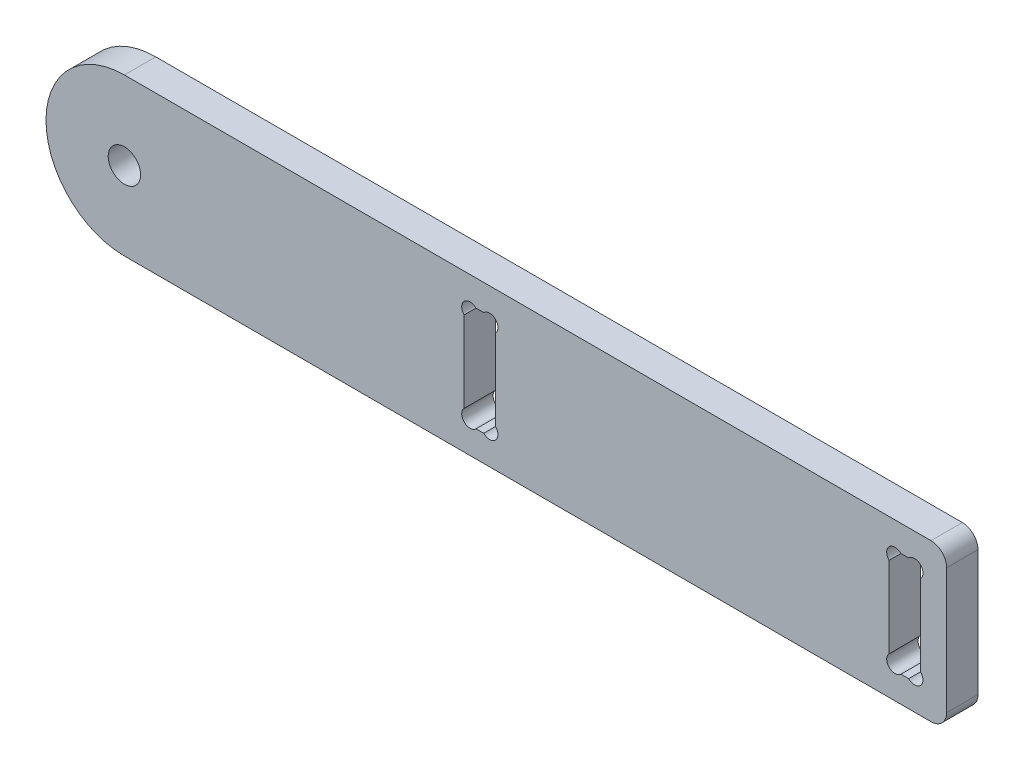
ISO-10303-21;
HEADER;
FILE_DESCRIPTION(('STEP AP214'),'2;1');
FILE_NAME('part.step','',(''),(''),'','','');
FILE_SCHEMA(('AUTOMOTIVE_DESIGN { 1 0 10303 214 1 1 1 1 }'));
ENDSEC;
DATA;
#1=APPLICATION_CONTEXT('core data for automotive mechanical design processes');
#2=APPLICATION_PROTOCOL_DEFINITION('international standard','automotive_design',2000,#1);
#3=PRODUCT_CONTEXT('',#1,'mechanical');
#4=PRODUCT('Part','Part','',(#3));
#5=PRODUCT_RELATED_PRODUCT_CATEGORY('part','',(#4));
#6=PRODUCT_DEFINITION_FORMATION('','',#4);
#7=PRODUCT_DEFINITION_CONTEXT('part definition',#1,'design');
#8=PRODUCT_DEFINITION('design','',#6,#7);
#9=PRODUCT_DEFINITION_SHAPE('','',#8);
#10=(LENGTH_UNIT() NAMED_UNIT(*) SI_UNIT(.MILLI.,.METRE.));
#11=(NAMED_UNIT(*) PLANE_ANGLE_UNIT() SI_UNIT($,.RADIAN.));
#12=(NAMED_UNIT(*) SI_UNIT($,.STERADIAN.) SOLID_ANGLE_UNIT());
#13=UNCERTAINTY_MEASURE_WITH_UNIT(LENGTH_MEASURE(1.E-05),#10,'distance_accuracy_value','');
#14=(GEOMETRIC_REPRESENTATION_CONTEXT(3) GLOBAL_UNCERTAINTY_ASSIGNED_CONTEXT((#13)) GLOBAL_UNIT_ASSIGNED_CONTEXT((#10,
#11,#12)) REPRESENTATION_CONTEXT('',''));
#15=CARTESIAN_POINT('',(0.,0.,0.));
#16=DIRECTION('',(0.,0.,1.));
#17=DIRECTION('',(1.,0.,0.));
#18=AXIS2_PLACEMENT_3D('',#15,#16,#17);
#19=CARTESIAN_POINT('',(94.31,27.,6.));
#20=DIRECTION('',(0.,0.,-1.));
#21=DIRECTION('',(-1.,0.,0.));
#22=AXIS2_PLACEMENT_3D('',#19,#20,#21);
#23=PLANE('',#22);
#24=CARTESIAN_POINT('',(9.86862915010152,23.8686291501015,6.));
#25=DIRECTION('',(0.,0.,1.));
#26=DIRECTION('',(1.,0.,0.));
#27=AXIS2_PLACEMENT_3D('',#24,#25,#26);
#28=CIRCLE('',#27,1.6);
#29=CARTESIAN_POINT('',(11.,22.737258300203,6.));
#30=VERTEX_POINT('',#29);
#31=CARTESIAN_POINT('',(8.73725830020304,25.,6.));
#32=VERTEX_POINT('',#31);
#33=EDGE_CURVE('E262',#30,#32,#28,.T.);
#34=ORIENTED_EDGE('',*,*,#33,.F.);
#35=DIRECTION('',(0.,1.,0.));
#36=VECTOR('',#35,1.);
#37=CARTESIAN_POINT('',(11.,22.737258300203,6.));
#38=LINE('',#37,#36);
#39=CARTESIAN_POINT('',(11.,7.26274169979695,6.));
#40=VERTEX_POINT('',#39);
#41=EDGE_CURVE('E277',#40,#30,#38,.T.);
#42=ORIENTED_EDGE('',*,*,#41,.F.);
#43=CARTESIAN_POINT('',(9.86862915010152,6.13137084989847,6.));
#44=DIRECTION('',(0.,0.,1.));
#45=DIRECTION('',(-1.,0.,0.));
#46=AXIS2_PLACEMENT_3D('',#43,#44,#45);
#47=CIRCLE('',#46,1.6);
#48=CARTESIAN_POINT('',(8.73725830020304,5.,6.));
#49=VERTEX_POINT('',#48);
#50=EDGE_CURVE('E274',#49,#40,#47,.T.);
#51=ORIENTED_EDGE('',*,*,#50,.F.);
#52=DIRECTION('',(1.,0.,0.));
#53=VECTOR('',#52,1.);
#54=CARTESIAN_POINT('',(7.26274169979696,5.,6.));
#55=LINE('',#54,#53);
#56=CARTESIAN_POINT('',(7.26274169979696,5.,6.));
#57=VERTEX_POINT('',#56);
#58=EDGE_CURVE('E272',#57,#49,#55,.T.);
#59=ORIENTED_EDGE('',*,*,#58,.F.);
#60=CARTESIAN_POINT('',(6.13137084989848,6.13137084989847,6.));
#61=DIRECTION('',(0.,0.,1.));
#62=DIRECTION('',(1.,0.,0.));
#63=AXIS2_PLACEMENT_3D('',#60,#61,#62);
#64=CIRCLE('',#63,1.6);
#65=CARTESIAN_POINT('',(5.,7.26274169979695,6.));
#66=VERTEX_POINT('',#65);
#67=EDGE_CURVE('E270',#66,#57,#64,.T.);
#68=ORIENTED_EDGE('',*,*,#67,.F.);
#69=DIRECTION('',(0.,-1.,0.));
#70=VECTOR('',#69,1.);
#71=CARTESIAN_POINT('',(5.,22.737258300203,6.));
#72=LINE('',#71,#70);
#73=CARTESIAN_POINT('',(5.,22.737258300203,6.));
#74=VERTEX_POINT('',#73);
#75=EDGE_CURVE('E268',#74,#66,#72,.T.);
#76=ORIENTED_EDGE('',*,*,#75,.F.);
#77=CARTESIAN_POINT('',(6.13137084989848,23.8686291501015,6.));
#78=DIRECTION('',(0.,0.,1.));
#79=DIRECTION('',(-1.,0.,0.));
#80=AXIS2_PLACEMENT_3D('',#77,#78,#79);
#81=CIRCLE('',#80,1.6);
#82=CARTESIAN_POINT('',(7.26274169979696,25.,6.));
#83=VERTEX_POINT('',#82);
#84=EDGE_CURVE('E266',#83,#74,#81,.T.);
#85=ORIENTED_EDGE('',*,*,#84,.F.);
#86=DIRECTION('',(-1.,0.,0.));
#87=VECTOR('',#86,1.);
#88=CARTESIAN_POINT('',(7.26274169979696,25.,6.));
#89=LINE('',#88,#87);
#90=EDGE_CURVE('E264',#32,#83,#89,.T.);
#91=ORIENTED_EDGE('',*,*,#90,.F.);
#92=EDGE_LOOP('',(#34,#42,#51,#59,#68,#76,#85,#91));
#93=FACE_BOUND('',#92,.T.);
#94=CARTESIAN_POINT('',(94.31,27.,6.));
#95=DIRECTION('',(0.,0.,1.));
#96=DIRECTION('',(-1.,0.,0.));
#97=AXIS2_PLACEMENT_3D('',#94,#95,#96);
#98=CIRCLE('',#97,3.);
#99=CARTESIAN_POINT('',(97.31,27.,6.));
#100=VERTEX_POINT('',#99);
#101=CARTESIAN_POINT('',(94.31,30.,6.));
#102=VERTEX_POINT('',#101);
#103=EDGE_CURVE('E316',#100,#102,#98,.T.);
#104=ORIENTED_EDGE('',*,*,#103,.T.);
#105=DIRECTION('',(-1.,0.,0.));
#106=VECTOR('',#105,1.);
#107=CARTESIAN_POINT('',(-60.,30.,6.));
#108=LINE('',#107,#106);
#109=CARTESIAN_POINT('',(-60.,30.,6.));
#110=VERTEX_POINT('',#109);
#111=EDGE_CURVE('E319',#102,#110,#108,.T.);
#112=ORIENTED_EDGE('',*,*,#111,.T.);
#113=CARTESIAN_POINT('',(-60.,15.,6.));
#114=DIRECTION('',(0.,0.,1.));
#115=DIRECTION('',(1.,0.,0.));
#116=AXIS2_PLACEMENT_3D('',#113,#114,#115);
#117=CIRCLE('',#116,15.);
#118=CARTESIAN_POINT('',(-60.,0.,6.));
#119=VERTEX_POINT('',#118);
#120=EDGE_CURVE('E321',#110,#119,#117,.T.);
#121=ORIENTED_EDGE('',*,*,#120,.T.);
#122=DIRECTION('',(1.,0.,0.));
#123=VECTOR('',#122,1.);
#124=CARTESIAN_POINT('',(94.31,0.,6.));
#125=LINE('',#124,#123);
#126=CARTESIAN_POINT('',(94.31,0.,6.));
#127=VERTEX_POINT('',#126);
#128=EDGE_CURVE('E323',#119,#127,#125,.T.);
#129=ORIENTED_EDGE('',*,*,#128,.T.);
#130=CARTESIAN_POINT('',(94.31,3.,6.));
#131=DIRECTION('',(0.,0.,1.));
#132=DIRECTION('',(1.,0.,0.));
#133=AXIS2_PLACEMENT_3D('',#130,#131,#132);
#134=CIRCLE('',#133,3.);
#135=CARTESIAN_POINT('',(97.31,3.00000000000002,6.));
#136=VERTEX_POINT('',#135);
#137=EDGE_CURVE('E325',#127,#136,#134,.T.);
#138=ORIENTED_EDGE('',*,*,#137,.T.);
#139=DIRECTION('',(0.,1.,0.));
#140=VECTOR('',#139,1.);
#141=CARTESIAN_POINT('',(97.31,3.00000000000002,6.));
#142=LINE('',#141,#140);
#143=EDGE_CURVE('E327',#136,#100,#142,.T.);
#144=ORIENTED_EDGE('',*,*,#143,.T.);
#145=EDGE_LOOP('',(#104,#112,#121,#129,#138,#144));
#146=FACE_BOUND('',#145,.T.);
#147=CARTESIAN_POINT('',(-60.,15.,6.));
#148=DIRECTION('',(0.,0.,1.));
#149=DIRECTION('',(1.,0.,0.));
#150=AXIS2_PLACEMENT_3D('',#147,#148,#149);
#151=CIRCLE('',#150,3.1);
#152=CARTESIAN_POINT('',(-56.9,15.,6.));
#153=VERTEX_POINT('',#152);
#154=EDGE_CURVE('E300',#153,#153,#151,.T.);
#155=ORIENTED_EDGE('',*,*,#154,.F.);
#156=EDGE_LOOP('',(#155));
#157=FACE_BOUND('',#156,.T.);
#158=CARTESIAN_POINT('',(91.1786291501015,6.13137084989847,6.));
#159=DIRECTION('',(0.,0.,1.));
#160=DIRECTION('',(-1.,0.,0.));
#161=AXIS2_PLACEMENT_3D('',#158,#159,#160);
#162=CIRCLE('',#161,1.6);
#163=CARTESIAN_POINT('',(90.0472583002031,5.,6.));
#164=VERTEX_POINT('',#163);
#165=CARTESIAN_POINT('',(92.31,7.26274169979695,6.));
#166=VERTEX_POINT('',#165);
#167=EDGE_CURVE('E190',#164,#166,#162,.T.);
#168=ORIENTED_EDGE('',*,*,#167,.F.);
#169=DIRECTION('',(1.,0.,0.));
#170=VECTOR('',#169,1.);
#171=CARTESIAN_POINT('',(90.0472583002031,5.,6.));
#172=LINE('',#171,#170);
#173=CARTESIAN_POINT('',(88.572741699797,5.,6.));
#174=VERTEX_POINT('',#173);
#175=EDGE_CURVE('E225',#174,#164,#172,.T.);
#176=ORIENTED_EDGE('',*,*,#175,.F.);
#177=CARTESIAN_POINT('',(87.4413708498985,6.13137084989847,6.));
#178=DIRECTION('',(0.,0.,1.));
#179=DIRECTION('',(1.,0.,0.));
#180=AXIS2_PLACEMENT_3D('',#177,#178,#179);
#181=CIRCLE('',#180,1.6);
#182=CARTESIAN_POINT('',(86.31,7.26274169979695,6.));
#183=VERTEX_POINT('',#182);
#184=EDGE_CURVE('E223',#183,#174,#181,.T.);
#185=ORIENTED_EDGE('',*,*,#184,.F.);
#186=DIRECTION('',(0.,-1.,0.));
#187=VECTOR('',#186,1.);
#188=CARTESIAN_POINT('',(86.31,22.737258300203,6.));
#189=LINE('',#188,#187);
#190=CARTESIAN_POINT('',(86.31,22.737258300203,6.));
#191=VERTEX_POINT('',#190);
#192=EDGE_CURVE('E221',#191,#183,#189,.T.);
#193=ORIENTED_EDGE('',*,*,#192,.F.);
#194=CARTESIAN_POINT('',(87.4413708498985,23.8686291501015,6.));
#195=DIRECTION('',(0.,0.,1.));
#196=DIRECTION('',(-1.,0.,0.));
#197=AXIS2_PLACEMENT_3D('',#194,#195,#196);
#198=CIRCLE('',#197,1.6);
#199=CARTESIAN_POINT('',(88.572741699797,25.,6.));
#200=VERTEX_POINT('',#199);
#201=EDGE_CURVE('E219',#200,#191,#198,.T.);
#202=ORIENTED_EDGE('',*,*,#201,.F.);
#203=DIRECTION('',(-1.,0.,0.));
#204=VECTOR('',#203,1.);
#205=CARTESIAN_POINT('',(90.0472583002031,25.,6.));
#206=LINE('',#205,#204);
#207=CARTESIAN_POINT('',(90.0472583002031,25.,6.));
#208=VERTEX_POINT('',#207);
#209=EDGE_CURVE('E217',#208,#200,#206,.T.);
#210=ORIENTED_EDGE('',*,*,#209,.F.);
#211=CARTESIAN_POINT('',(91.1786291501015,23.8686291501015,6.));
#212=DIRECTION('',(0.,0.,1.));
#213=DIRECTION('',(1.,0.,0.));
#214=AXIS2_PLACEMENT_3D('',#211,#212,#213);
#215=CIRCLE('',#214,1.6);
#216=CARTESIAN_POINT('',(92.31,22.737258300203,6.));
#217=VERTEX_POINT('',#216);
#218=EDGE_CURVE('E215',#217,#208,#215,.T.);
#219=ORIENTED_EDGE('',*,*,#218,.F.);
#220=DIRECTION('',(0.,1.,0.));
#221=VECTOR('',#220,1.);
#222=CARTESIAN_POINT('',(92.31,22.737258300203,6.));
#223=LINE('',#222,#221);
#224=EDGE_CURVE('E213',#166,#217,#223,.T.);
#225=ORIENTED_EDGE('',*,*,#224,.F.);
#226=EDGE_LOOP('',(#168,#176,#185,#193,#202,#210,#219,#225));
#227=FACE_BOUND('',#226,.T.);
#228=ADVANCED_FACE('F26',(#93,#146,#157,#227),#23,.F.);
#229=CARTESIAN_POINT('',(94.31,27.,0.));
#230=DIRECTION('',(0.,0.,-1.));
#231=DIRECTION('',(-1.,0.,0.));
#232=AXIS2_PLACEMENT_3D('',#229,#230,#231);
#233=PLANE('',#232);
#234=DIRECTION('',(0.,1.,0.));
#235=VECTOR('',#234,1.);
#236=CARTESIAN_POINT('',(11.,22.737258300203,0.));
#237=LINE('',#236,#235);
#238=CARTESIAN_POINT('',(11.,7.26274169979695,0.));
#239=VERTEX_POINT('',#238);
#240=CARTESIAN_POINT('',(11.,22.737258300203,0.));
#241=VERTEX_POINT('',#240);
#242=EDGE_CURVE('E259',#239,#241,#237,.T.);
#243=ORIENTED_EDGE('',*,*,#242,.T.);
#244=CARTESIAN_POINT('',(9.86862915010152,23.8686291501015,0.));
#245=DIRECTION('',(0.,0.,1.));
#246=DIRECTION('',(1.,0.,0.));
#247=AXIS2_PLACEMENT_3D('',#244,#245,#246);
#248=CIRCLE('',#247,1.6);
#249=CARTESIAN_POINT('',(8.73725830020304,25.,0.));
#250=VERTEX_POINT('',#249);
#251=EDGE_CURVE('E191',#241,#250,#248,.T.);
#252=ORIENTED_EDGE('',*,*,#251,.T.);
#253=DIRECTION('',(-1.,0.,0.));
#254=VECTOR('',#253,1.);
#255=CARTESIAN_POINT('',(7.26274169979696,25.,0.));
#256=LINE('',#255,#254);
#257=CARTESIAN_POINT('',(7.26274169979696,25.,0.));
#258=VERTEX_POINT('',#257);
#259=EDGE_CURVE('E241',#250,#258,#256,.T.);
#260=ORIENTED_EDGE('',*,*,#259,.T.);
#261=CARTESIAN_POINT('',(6.13137084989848,23.8686291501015,0.));
#262=DIRECTION('',(0.,0.,1.));
#263=DIRECTION('',(-1.,0.,0.));
#264=AXIS2_PLACEMENT_3D('',#261,#262,#263);
#265=CIRCLE('',#264,1.6);
#266=CARTESIAN_POINT('',(5.,22.737258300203,0.));
#267=VERTEX_POINT('',#266);
#268=EDGE_CURVE('E244',#258,#267,#265,.T.);
#269=ORIENTED_EDGE('',*,*,#268,.T.);
#270=DIRECTION('',(0.,-1.,0.));
#271=VECTOR('',#270,1.);
#272=CARTESIAN_POINT('',(5.,22.737258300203,0.));
#273=LINE('',#272,#271);
#274=CARTESIAN_POINT('',(5.,7.26274169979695,0.));
#275=VERTEX_POINT('',#274);
#276=EDGE_CURVE('E247',#267,#275,#273,.T.);
#277=ORIENTED_EDGE('',*,*,#276,.T.);
#278=CARTESIAN_POINT('',(6.13137084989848,6.13137084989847,0.));
#279=DIRECTION('',(0.,0.,1.));
#280=DIRECTION('',(1.,0.,0.));
#281=AXIS2_PLACEMENT_3D('',#278,#279,#280);
#282=CIRCLE('',#281,1.6);
#283=CARTESIAN_POINT('',(7.26274169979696,5.,0.));
#284=VERTEX_POINT('',#283);
#285=EDGE_CURVE('E250',#275,#284,#282,.T.);
#286=ORIENTED_EDGE('',*,*,#285,.T.);
#287=DIRECTION('',(1.,0.,0.));
#288=VECTOR('',#287,1.);
#289=CARTESIAN_POINT('',(7.26274169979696,5.,0.));
#290=LINE('',#289,#288);
#291=CARTESIAN_POINT('',(8.73725830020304,5.,0.));
#292=VERTEX_POINT('',#291);
#293=EDGE_CURVE('E253',#284,#292,#290,.T.);
#294=ORIENTED_EDGE('',*,*,#293,.T.);
#295=CARTESIAN_POINT('',(9.86862915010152,6.13137084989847,0.));
#296=DIRECTION('',(0.,0.,1.));
#297=DIRECTION('',(-1.,0.,0.));
#298=AXIS2_PLACEMENT_3D('',#295,#296,#297);
#299=CIRCLE('',#298,1.6);
#300=EDGE_CURVE('E256',#292,#239,#299,.T.);
#301=ORIENTED_EDGE('',*,*,#300,.T.);
#302=EDGE_LOOP('',(#243,#252,#260,#269,#277,#286,#294,#301));
#303=FACE_BOUND('',#302,.T.);
#304=CARTESIAN_POINT('',(94.31,27.,0.));
#305=DIRECTION('',(0.,0.,1.));
#306=DIRECTION('',(-1.,0.,0.));
#307=AXIS2_PLACEMENT_3D('',#304,#305,#306);
#308=CIRCLE('',#307,3.);
#309=CARTESIAN_POINT('',(97.31,27.,0.));
#310=VERTEX_POINT('',#309);
#311=CARTESIAN_POINT('',(94.31,30.,0.));
#312=VERTEX_POINT('',#311);
#313=EDGE_CURVE('E303',#310,#312,#308,.T.);
#314=ORIENTED_EDGE('',*,*,#313,.F.);
#315=DIRECTION('',(0.,1.,0.));
#316=VECTOR('',#315,1.);
#317=CARTESIAN_POINT('',(97.31,3.00000000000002,0.));
#318=LINE('',#317,#316);
#319=CARTESIAN_POINT('',(97.31,3.00000000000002,0.));
#320=VERTEX_POINT('',#319);
#321=EDGE_CURVE('E314',#320,#310,#318,.T.);
#322=ORIENTED_EDGE('',*,*,#321,.F.);
#323=CARTESIAN_POINT('',(94.31,3.,0.));
#324=DIRECTION('',(0.,0.,1.));
#325=DIRECTION('',(1.,0.,0.));
#326=AXIS2_PLACEMENT_3D('',#323,#324,#325);
#327=CIRCLE('',#326,3.);
#328=CARTESIAN_POINT('',(94.31,0.,0.));
#329=VERTEX_POINT('',#328);
#330=EDGE_CURVE('E312',#329,#320,#327,.T.);
#331=ORIENTED_EDGE('',*,*,#330,.F.);
#332=DIRECTION('',(1.,0.,0.));
#333=VECTOR('',#332,1.);
#334=CARTESIAN_POINT('',(94.31,0.,0.));
#335=LINE('',#334,#333);
#336=CARTESIAN_POINT('',(-60.,0.,0.));
#337=VERTEX_POINT('',#336);
#338=EDGE_CURVE('E310',#337,#329,#335,.T.);
#339=ORIENTED_EDGE('',*,*,#338,.F.);
#340=CARTESIAN_POINT('',(-60.,15.,0.));
#341=DIRECTION('',(0.,0.,1.));
#342=DIRECTION('',(1.,0.,0.));
#343=AXIS2_PLACEMENT_3D('',#340,#341,#342);
#344=CIRCLE('',#343,15.);
#345=CARTESIAN_POINT('',(-60.,30.,0.));
#346=VERTEX_POINT('',#345);
#347=EDGE_CURVE('E308',#346,#337,#344,.T.);
#348=ORIENTED_EDGE('',*,*,#347,.F.);
#349=DIRECTION('',(-1.,0.,0.));
#350=VECTOR('',#349,1.);
#351=CARTESIAN_POINT('',(-60.,30.,0.));
#352=LINE('',#351,#350);
#353=EDGE_CURVE('E306',#312,#346,#352,.T.);
#354=ORIENTED_EDGE('',*,*,#353,.F.);
#355=EDGE_LOOP('',(#314,#322,#331,#339,#348,#354));
#356=FACE_BOUND('',#355,.T.);
#357=CARTESIAN_POINT('',(-60.,15.,0.));
#358=DIRECTION('',(0.,0.,1.));
#359=DIRECTION('',(1.,0.,0.));
#360=AXIS2_PLACEMENT_3D('',#357,#358,#359);
#361=CIRCLE('',#360,3.1);
#362=CARTESIAN_POINT('',(-56.9,15.,0.));
#363=VERTEX_POINT('',#362);
#364=EDGE_CURVE('E297',#363,#363,#361,.T.);
#365=ORIENTED_EDGE('',*,*,#364,.T.);
#366=EDGE_LOOP('',(#365));
#367=FACE_BOUND('',#366,.T.);
#368=DIRECTION('',(1.,0.,0.));
#369=VECTOR('',#368,1.);
#370=CARTESIAN_POINT('',(90.0472583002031,5.,0.));
#371=LINE('',#370,#369);
#372=CARTESIAN_POINT('',(88.572741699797,5.,0.));
#373=VERTEX_POINT('',#372);
#374=CARTESIAN_POINT('',(90.0472583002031,5.,0.));
#375=VERTEX_POINT('',#374);
#376=EDGE_CURVE('E196',#373,#375,#371,.T.);
#377=ORIENTED_EDGE('',*,*,#376,.T.);
#378=CARTESIAN_POINT('',(91.1786291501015,6.13137084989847,0.));
#379=DIRECTION('',(0.,0.,1.));
#380=DIRECTION('',(-1.,0.,0.));
#381=AXIS2_PLACEMENT_3D('',#378,#379,#380);
#382=CIRCLE('',#381,1.6);
#383=CARTESIAN_POINT('',(92.31,7.26274169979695,0.));
#384=VERTEX_POINT('',#383);
#385=EDGE_CURVE('E49',#375,#384,#382,.T.);
#386=ORIENTED_EDGE('',*,*,#385,.T.);
#387=DIRECTION('',(0.,1.,0.));
#388=VECTOR('',#387,1.);
#389=CARTESIAN_POINT('',(92.31,22.737258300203,0.));
#390=LINE('',#389,#388);
#391=CARTESIAN_POINT('',(92.31,22.737258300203,0.));
#392=VERTEX_POINT('',#391);
#393=EDGE_CURVE('E177',#384,#392,#390,.T.);
#394=ORIENTED_EDGE('',*,*,#393,.T.);
#395=CARTESIAN_POINT('',(91.1786291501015,23.8686291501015,0.));
#396=DIRECTION('',(0.,0.,1.));
#397=DIRECTION('',(1.,0.,0.));
#398=AXIS2_PLACEMENT_3D('',#395,#396,#397);
#399=CIRCLE('',#398,1.6);
#400=CARTESIAN_POINT('',(90.0472583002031,25.,0.));
#401=VERTEX_POINT('',#400);
#402=EDGE_CURVE('E186',#392,#401,#399,.T.);
#403=ORIENTED_EDGE('',*,*,#402,.T.);
#404=DIRECTION('',(-1.,0.,0.));
#405=VECTOR('',#404,1.);
#406=CARTESIAN_POINT('',(90.0472583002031,25.,0.));
#407=LINE('',#406,#405);
#408=CARTESIAN_POINT('',(88.572741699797,25.,0.));
#409=VERTEX_POINT('',#408);
#410=EDGE_CURVE('E200',#401,#409,#407,.T.);
#411=ORIENTED_EDGE('',*,*,#410,.T.);
#412=CARTESIAN_POINT('',(87.4413708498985,23.8686291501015,0.));
#413=DIRECTION('',(0.,0.,1.));
#414=DIRECTION('',(-1.,0.,0.));
#415=AXIS2_PLACEMENT_3D('',#412,#413,#414);
#416=CIRCLE('',#415,1.6);
#417=CARTESIAN_POINT('',(86.31,22.737258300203,0.));
#418=VERTEX_POINT('',#417);
#419=EDGE_CURVE('E203',#409,#418,#416,.T.);
#420=ORIENTED_EDGE('',*,*,#419,.T.);
#421=DIRECTION('',(0.,-1.,0.));
#422=VECTOR('',#421,1.);
#423=CARTESIAN_POINT('',(86.31,22.737258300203,0.));
#424=LINE('',#423,#422);
#425=CARTESIAN_POINT('',(86.31,7.26274169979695,0.));
#426=VERTEX_POINT('',#425);
#427=EDGE_CURVE('E206',#418,#426,#424,.T.);
#428=ORIENTED_EDGE('',*,*,#427,.T.);
#429=CARTESIAN_POINT('',(87.4413708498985,6.13137084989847,0.));
#430=DIRECTION('',(0.,0.,1.));
#431=DIRECTION('',(1.,0.,0.));
#432=AXIS2_PLACEMENT_3D('',#429,#430,#431);
#433=CIRCLE('',#432,1.6);
#434=EDGE_CURVE('E209',#426,#373,#433,.T.);
#435=ORIENTED_EDGE('',*,*,#434,.T.);
#436=EDGE_LOOP('',(#377,#386,#394,#403,#411,#420,#428,#435));
#437=FACE_BOUND('',#436,.T.);
#438=ADVANCED_FACE('F194',(#303,#356,#367,#437),#233,.T.);
#439=CARTESIAN_POINT('',(94.31,27.,6.));
#440=DIRECTION('',(0.,0.,-1.));
#441=DIRECTION('',(-1.,0.,0.));
#442=AXIS2_PLACEMENT_3D('',#439,#440,#441);
#443=CYLINDRICAL_SURFACE('',#442,3.);
#444=ORIENTED_EDGE('',*,*,#313,.T.);
#445=DIRECTION('',(0.,0.,-1.));
#446=VECTOR('',#445,1.);
#447=CARTESIAN_POINT('',(94.31,30.,6.));
#448=LINE('',#447,#446);
#449=EDGE_CURVE('E11',#102,#312,#448,.T.);
#450=ORIENTED_EDGE('',*,*,#449,.F.);
#451=ORIENTED_EDGE('',*,*,#103,.F.);
#452=DIRECTION('',(0.,0.,-1.));
#453=VECTOR('',#452,1.);
#454=CARTESIAN_POINT('',(97.31,27.,6.));
#455=LINE('',#454,#453);
#456=EDGE_CURVE('E329',#100,#310,#455,.T.);
#457=ORIENTED_EDGE('',*,*,#456,.T.);
#458=EDGE_LOOP('',(#444,#450,#451,#457));
#459=FACE_BOUND('',#458,.T.);
#460=ADVANCED_FACE('F28',(#459),#443,.T.);
#461=CARTESIAN_POINT('',(-60.,30.,6.));
#462=DIRECTION('',(0.,-1.,0.));
#463=DIRECTION('',(0.,0.,-1.));
#464=AXIS2_PLACEMENT_3D('',#461,#462,#463);
#465=PLANE('',#464);
#466=ORIENTED_EDGE('',*,*,#353,.T.);
#467=DIRECTION('',(0.,0.,-1.));
#468=VECTOR('',#467,1.);
#469=CARTESIAN_POINT('',(-60.,30.,6.));
#470=LINE('',#469,#468);
#471=EDGE_CURVE('E34',#110,#346,#470,.T.);
#472=ORIENTED_EDGE('',*,*,#471,.F.);
#473=ORIENTED_EDGE('',*,*,#111,.F.);
#474=ORIENTED_EDGE('',*,*,#449,.T.);
#475=EDGE_LOOP('',(#466,#472,#473,#474));
#476=FACE_BOUND('',#475,.T.);
#477=ADVANCED_FACE('F368',(#476),#465,.F.);
#478=CARTESIAN_POINT('',(-60.,15.,6.));
#479=DIRECTION('',(0.,0.,-1.));
#480=DIRECTION('',(-1.,0.,0.));
#481=AXIS2_PLACEMENT_3D('',#478,#479,#480);
#482=CYLINDRICAL_SURFACE('',#481,15.);
#483=ORIENTED_EDGE('',*,*,#347,.T.);
#484=DIRECTION('',(0.,0.,-1.));
#485=VECTOR('',#484,1.);
#486=CARTESIAN_POINT('',(-60.,0.,6.));
#487=LINE('',#486,#485);
#488=EDGE_CURVE('E338',#119,#337,#487,.T.);
#489=ORIENTED_EDGE('',*,*,#488,.F.);
#490=ORIENTED_EDGE('',*,*,#120,.F.);
#491=ORIENTED_EDGE('',*,*,#471,.T.);
#492=EDGE_LOOP('',(#483,#489,#490,#491));
#493=FACE_BOUND('',#492,.T.);
#494=ADVANCED_FACE('F345',(#493),#482,.T.);
#495=CARTESIAN_POINT('',(94.31,0.,6.));
#496=DIRECTION('',(0.,1.,0.));
#497=DIRECTION('',(-1.,0.,0.));
#498=AXIS2_PLACEMENT_3D('',#495,#496,#497);
#499=PLANE('',#498);
#500=ORIENTED_EDGE('',*,*,#338,.T.);
#501=DIRECTION('',(0.,0.,-1.));
#502=VECTOR('',#501,1.);
#503=CARTESIAN_POINT('',(94.31,0.,6.));
#504=LINE('',#503,#502);
#505=EDGE_CURVE('E335',#127,#329,#504,.T.);
#506=ORIENTED_EDGE('',*,*,#505,.F.);
#507=ORIENTED_EDGE('',*,*,#128,.F.);
#508=ORIENTED_EDGE('',*,*,#488,.T.);
#509=EDGE_LOOP('',(#500,#506,#507,#508));
#510=FACE_BOUND('',#509,.T.);
#511=ADVANCED_FACE('F356',(#510),#499,.F.);
#512=CARTESIAN_POINT('',(94.31,3.,6.));
#513=DIRECTION('',(0.,0.,-1.));
#514=DIRECTION('',(-1.,0.,0.));
#515=AXIS2_PLACEMENT_3D('',#512,#513,#514);
#516=CYLINDRICAL_SURFACE('',#515,3.);
#517=ORIENTED_EDGE('',*,*,#330,.T.);
#518=DIRECTION('',(0.,0.,-1.));
#519=VECTOR('',#518,1.);
#520=CARTESIAN_POINT('',(97.31,3.00000000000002,6.));
#521=LINE('',#520,#519);
#522=EDGE_CURVE('E332',#136,#320,#521,.T.);
#523=ORIENTED_EDGE('',*,*,#522,.F.);
#524=ORIENTED_EDGE('',*,*,#137,.F.);
#525=ORIENTED_EDGE('',*,*,#505,.T.);
#526=EDGE_LOOP('',(#517,#523,#524,#525));
#527=FACE_BOUND('',#526,.T.);
#528=ADVANCED_FACE('F360',(#527),#516,.T.);
#529=CARTESIAN_POINT('',(97.31,3.00000000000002,6.));
#530=DIRECTION('',(-1.,0.,0.));
#531=DIRECTION('',(0.,0.,1.));
#532=AXIS2_PLACEMENT_3D('',#529,#530,#531);
#533=PLANE('',#532);
#534=ORIENTED_EDGE('',*,*,#321,.T.);
#535=ORIENTED_EDGE('',*,*,#456,.F.);
#536=ORIENTED_EDGE('',*,*,#143,.F.);
#537=ORIENTED_EDGE('',*,*,#522,.T.);
#538=EDGE_LOOP('',(#534,#535,#536,#537));
#539=FACE_BOUND('',#538,.T.);
#540=ADVANCED_FACE('F371',(#539),#533,.F.);
#541=CARTESIAN_POINT('',(-60.,15.,6.));
#542=DIRECTION('',(0.,0.,-1.));
#543=DIRECTION('',(-1.,0.,0.));
#544=AXIS2_PLACEMENT_3D('',#541,#542,#543);
#545=CYLINDRICAL_SURFACE('',#544,3.1);
#546=ORIENTED_EDGE('',*,*,#154,.T.);
#547=EDGE_LOOP('',(#546));
#548=FACE_BOUND('',#547,.T.);
#549=ORIENTED_EDGE('',*,*,#364,.F.);
#550=EDGE_LOOP('',(#549));
#551=FACE_BOUND('',#550,.T.);
#552=ADVANCED_FACE('F373',(#548,#551),#545,.F.);
#553=CARTESIAN_POINT('',(9.86862915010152,23.8686291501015,6.));
#554=DIRECTION('',(0.,0.,-1.));
#555=DIRECTION('',(-1.,0.,0.));
#556=AXIS2_PLACEMENT_3D('',#553,#554,#555);
#557=CYLINDRICAL_SURFACE('',#556,1.6);
#558=ORIENTED_EDGE('',*,*,#251,.F.);
#559=DIRECTION('',(0.,0.,-1.));
#560=VECTOR('',#559,1.);
#561=CARTESIAN_POINT('',(11.,22.737258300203,6.));
#562=LINE('',#561,#560);
#563=EDGE_CURVE('E279',#30,#241,#562,.T.);
#564=ORIENTED_EDGE('',*,*,#563,.F.);
#565=ORIENTED_EDGE('',*,*,#33,.T.);
#566=DIRECTION('',(0.,0.,-1.));
#567=VECTOR('',#566,1.);
#568=CARTESIAN_POINT('',(8.73725830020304,25.,6.));
#569=LINE('',#568,#567);
#570=EDGE_CURVE('E294',#32,#250,#569,.T.);
#571=ORIENTED_EDGE('',*,*,#570,.T.);
#572=EDGE_LOOP('',(#558,#564,#565,#571));
#573=FACE_BOUND('',#572,.T.);
#574=ADVANCED_FACE('F379',(#573),#557,.F.);
#575=CARTESIAN_POINT('',(7.26274169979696,25.,6.));
#576=DIRECTION('',(0.,-1.,0.));
#577=DIRECTION('',(0.,0.,-1.));
#578=AXIS2_PLACEMENT_3D('',#575,#576,#577);
#579=PLANE('',#578);
#580=ORIENTED_EDGE('',*,*,#259,.F.);
#581=ORIENTED_EDGE('',*,*,#570,.F.);
#582=ORIENTED_EDGE('',*,*,#90,.T.);
#583=DIRECTION('',(0.,0.,-1.));
#584=VECTOR('',#583,1.);
#585=CARTESIAN_POINT('',(7.26274169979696,25.,6.));
#586=LINE('',#585,#584);
#587=EDGE_CURVE('E292',#83,#258,#586,.T.);
#588=ORIENTED_EDGE('',*,*,#587,.T.);
#589=EDGE_LOOP('',(#580,#581,#582,#588));
#590=FACE_BOUND('',#589,.T.);
#591=ADVANCED_FACE('F395',(#590),#579,.T.);
#592=CARTESIAN_POINT('',(6.13137084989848,23.8686291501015,6.));
#593=DIRECTION('',(0.,0.,-1.));
#594=DIRECTION('',(-1.,0.,0.));
#595=AXIS2_PLACEMENT_3D('',#592,#593,#594);
#596=CYLINDRICAL_SURFACE('',#595,1.6);
#597=ORIENTED_EDGE('',*,*,#268,.F.);
#598=ORIENTED_EDGE('',*,*,#587,.F.);
#599=ORIENTED_EDGE('',*,*,#84,.T.);
#600=DIRECTION('',(0.,0.,-1.));
#601=VECTOR('',#600,1.);
#602=CARTESIAN_POINT('',(5.,22.737258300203,6.));
#603=LINE('',#602,#601);
#604=EDGE_CURVE('E290',#74,#267,#603,.T.);
#605=ORIENTED_EDGE('',*,*,#604,.T.);
#606=EDGE_LOOP('',(#597,#598,#599,#605));
#607=FACE_BOUND('',#606,.T.);
#608=ADVANCED_FACE('F399',(#607),#596,.F.);
#609=CARTESIAN_POINT('',(5.,22.737258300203,6.));
#610=DIRECTION('',(1.,0.,0.));
#611=DIRECTION('',(0.,0.,-1.));
#612=AXIS2_PLACEMENT_3D('',#609,#610,#611);
#613=PLANE('',#612);
#614=ORIENTED_EDGE('',*,*,#276,.F.);
#615=ORIENTED_EDGE('',*,*,#604,.F.);
#616=ORIENTED_EDGE('',*,*,#75,.T.);
#617=DIRECTION('',(0.,0.,-1.));
#618=VECTOR('',#617,1.);
#619=CARTESIAN_POINT('',(5.,7.26274169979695,6.));
#620=LINE('',#619,#618);
#621=EDGE_CURVE('E288',#66,#275,#620,.T.);
#622=ORIENTED_EDGE('',*,*,#621,.T.);
#623=EDGE_LOOP('',(#614,#615,#616,#622));
#624=FACE_BOUND('',#623,.T.);
#625=ADVANCED_FACE('F403',(#624),#613,.T.);
#626=CARTESIAN_POINT('',(6.13137084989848,6.13137084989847,6.));
#627=DIRECTION('',(0.,0.,-1.));
#628=DIRECTION('',(-1.,0.,0.));
#629=AXIS2_PLACEMENT_3D('',#626,#627,#628);
#630=CYLINDRICAL_SURFACE('',#629,1.6);
#631=ORIENTED_EDGE('',*,*,#285,.F.);
#632=ORIENTED_EDGE('',*,*,#621,.F.);
#633=ORIENTED_EDGE('',*,*,#67,.T.);
#634=DIRECTION('',(0.,0.,-1.));
#635=VECTOR('',#634,1.);
#636=CARTESIAN_POINT('',(7.26274169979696,5.,6.));
#637=LINE('',#636,#635);
#638=EDGE_CURVE('E286',#57,#284,#637,.T.);
#639=ORIENTED_EDGE('',*,*,#638,.T.);
#640=EDGE_LOOP('',(#631,#632,#633,#639));
#641=FACE_BOUND('',#640,.T.);
#642=ADVANCED_FACE('F407',(#641),#630,.F.);
#643=CARTESIAN_POINT('',(7.26274169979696,5.,6.));
#644=DIRECTION('',(0.,1.,0.));
#645=DIRECTION('',(0.,0.,1.));
#646=AXIS2_PLACEMENT_3D('',#643,#644,#645);
#647=PLANE('',#646);
#648=ORIENTED_EDGE('',*,*,#293,.F.);
#649=ORIENTED_EDGE('',*,*,#638,.F.);
#650=ORIENTED_EDGE('',*,*,#58,.T.);
#651=DIRECTION('',(0.,0.,-1.));
#652=VECTOR('',#651,1.);
#653=CARTESIAN_POINT('',(8.73725830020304,5.,6.));
#654=LINE('',#653,#652);
#655=EDGE_CURVE('E284',#49,#292,#654,.T.);
#656=ORIENTED_EDGE('',*,*,#655,.T.);
#657=EDGE_LOOP('',(#648,#649,#650,#656));
#658=FACE_BOUND('',#657,.T.);
#659=ADVANCED_FACE('F411',(#658),#647,.T.);
#660=CARTESIAN_POINT('',(9.86862915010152,6.13137084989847,6.));
#661=DIRECTION('',(0.,0.,-1.));
#662=DIRECTION('',(-1.,0.,0.));
#663=AXIS2_PLACEMENT_3D('',#660,#661,#662);
#664=CYLINDRICAL_SURFACE('',#663,1.6);
#665=ORIENTED_EDGE('',*,*,#300,.F.);
#666=ORIENTED_EDGE('',*,*,#655,.F.);
#667=ORIENTED_EDGE('',*,*,#50,.T.);
#668=DIRECTION('',(0.,0.,-1.));
#669=VECTOR('',#668,1.);
#670=CARTESIAN_POINT('',(11.,7.26274169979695,6.));
#671=LINE('',#670,#669);
#672=EDGE_CURVE('E282',#40,#239,#671,.T.);
#673=ORIENTED_EDGE('',*,*,#672,.T.);
#674=EDGE_LOOP('',(#665,#666,#667,#673));
#675=FACE_BOUND('',#674,.T.);
#676=ADVANCED_FACE('F415',(#675),#664,.F.);
#677=CARTESIAN_POINT('',(11.,22.737258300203,6.));
#678=DIRECTION('',(-1.,0.,0.));
#679=DIRECTION('',(0.,-1.,0.));
#680=AXIS2_PLACEMENT_3D('',#677,#678,#679);
#681=PLANE('',#680);
#682=ORIENTED_EDGE('',*,*,#242,.F.);
#683=ORIENTED_EDGE('',*,*,#672,.F.);
#684=ORIENTED_EDGE('',*,*,#41,.T.);
#685=ORIENTED_EDGE('',*,*,#563,.T.);
#686=EDGE_LOOP('',(#682,#683,#684,#685));
#687=FACE_BOUND('',#686,.T.);
#688=ADVANCED_FACE('F419',(#687),#681,.T.);
#689=CARTESIAN_POINT('',(91.1786291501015,6.13137084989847,6.));
#690=DIRECTION('',(0.,0.,-1.));
#691=DIRECTION('',(-1.,0.,0.));
#692=AXIS2_PLACEMENT_3D('',#689,#690,#691);
#693=CYLINDRICAL_SURFACE('',#692,1.6);
#694=ORIENTED_EDGE('',*,*,#385,.F.);
#695=DIRECTION('',(0.,0.,-1.));
#696=VECTOR('',#695,1.);
#697=CARTESIAN_POINT('',(90.0472583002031,5.,6.));
#698=LINE('',#697,#696);
#699=EDGE_CURVE('E227',#164,#375,#698,.T.);
#700=ORIENTED_EDGE('',*,*,#699,.F.);
#701=ORIENTED_EDGE('',*,*,#167,.T.);
#702=DIRECTION('',(0.,0.,-1.));
#703=VECTOR('',#702,1.);
#704=CARTESIAN_POINT('',(92.31,7.26274169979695,6.));
#705=LINE('',#704,#703);
#706=EDGE_CURVE('E179',#166,#384,#705,.T.);
#707=ORIENTED_EDGE('',*,*,#706,.T.);
#708=EDGE_LOOP('',(#694,#700,#701,#707));
#709=FACE_BOUND('',#708,.T.);
#710=ADVANCED_FACE('F188',(#709),#693,.F.);
#711=CARTESIAN_POINT('',(92.31,22.737258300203,6.));
#712=DIRECTION('',(-1.,0.,0.));
#713=DIRECTION('',(0.,0.,1.));
#714=AXIS2_PLACEMENT_3D('',#711,#712,#713);
#715=PLANE('',#714);
#716=ORIENTED_EDGE('',*,*,#393,.F.);
#717=ORIENTED_EDGE('',*,*,#706,.F.);
#718=ORIENTED_EDGE('',*,*,#224,.T.);
#719=DIRECTION('',(0.,0.,-1.));
#720=VECTOR('',#719,1.);
#721=CARTESIAN_POINT('',(92.31,22.737258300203,6.));
#722=LINE('',#721,#720);
#723=EDGE_CURVE('E182',#217,#392,#722,.T.);
#724=ORIENTED_EDGE('',*,*,#723,.T.);
#725=EDGE_LOOP('',(#716,#717,#718,#724));
#726=FACE_BOUND('',#725,.T.);
#727=ADVANCED_FACE('F178',(#726),#715,.T.);
#728=CARTESIAN_POINT('',(91.1786291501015,23.8686291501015,6.));
#729=DIRECTION('',(0.,0.,-1.));
#730=DIRECTION('',(-1.,0.,0.));
#731=AXIS2_PLACEMENT_3D('',#728,#729,#730);
#732=CYLINDRICAL_SURFACE('',#731,1.6);
#733=ORIENTED_EDGE('',*,*,#402,.F.);
#734=ORIENTED_EDGE('',*,*,#723,.F.);
#735=ORIENTED_EDGE('',*,*,#218,.T.);
#736=DIRECTION('',(0.,0.,-1.));
#737=VECTOR('',#736,1.);
#738=CARTESIAN_POINT('',(90.0472583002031,25.,6.));
#739=LINE('',#738,#737);
#740=EDGE_CURVE('E236',#208,#401,#739,.T.);
#741=ORIENTED_EDGE('',*,*,#740,.T.);
#742=EDGE_LOOP('',(#733,#734,#735,#741));
#743=FACE_BOUND('',#742,.T.);
#744=ADVANCED_FACE('F428',(#743),#732,.F.);
#745=CARTESIAN_POINT('',(90.0472583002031,25.,6.));
#746=DIRECTION('',(0.,-1.,0.));
#747=DIRECTION('',(0.,0.,-1.));
#748=AXIS2_PLACEMENT_3D('',#745,#746,#747);
#749=PLANE('',#748);
#750=ORIENTED_EDGE('',*,*,#410,.F.);
#751=ORIENTED_EDGE('',*,*,#740,.F.);
#752=ORIENTED_EDGE('',*,*,#209,.T.);
#753=DIRECTION('',(0.,0.,-1.));
#754=VECTOR('',#753,1.);
#755=CARTESIAN_POINT('',(88.572741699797,25.,6.));
#756=LINE('',#755,#754);
#757=EDGE_CURVE('E234',#200,#409,#756,.T.);
#758=ORIENTED_EDGE('',*,*,#757,.T.);
#759=EDGE_LOOP('',(#750,#751,#752,#758));
#760=FACE_BOUND('',#759,.T.);
#761=ADVANCED_FACE('F431',(#760),#749,.T.);
#762=CARTESIAN_POINT('',(87.4413708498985,23.8686291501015,6.));
#763=DIRECTION('',(0.,0.,-1.));
#764=DIRECTION('',(-1.,0.,0.));
#765=AXIS2_PLACEMENT_3D('',#762,#763,#764);
#766=CYLINDRICAL_SURFACE('',#765,1.6);
#767=ORIENTED_EDGE('',*,*,#419,.F.);
#768=ORIENTED_EDGE('',*,*,#757,.F.);
#769=ORIENTED_EDGE('',*,*,#201,.T.);
#770=DIRECTION('',(0.,0.,-1.));
#771=VECTOR('',#770,1.);
#772=CARTESIAN_POINT('',(86.31,22.737258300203,6.));
#773=LINE('',#772,#771);
#774=EDGE_CURVE('E232',#191,#418,#773,.T.);
#775=ORIENTED_EDGE('',*,*,#774,.T.);
#776=EDGE_LOOP('',(#767,#768,#769,#775));
#777=FACE_BOUND('',#776,.T.);
#778=ADVANCED_FACE('F435',(#777),#766,.F.);
#779=CARTESIAN_POINT('',(86.31,22.737258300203,6.));
#780=DIRECTION('',(1.,0.,0.));
#781=DIRECTION('',(0.,0.,-1.));
#782=AXIS2_PLACEMENT_3D('',#779,#780,#781);
#783=PLANE('',#782);
#784=ORIENTED_EDGE('',*,*,#427,.F.);
#785=ORIENTED_EDGE('',*,*,#774,.F.);
#786=ORIENTED_EDGE('',*,*,#192,.T.);
#787=DIRECTION('',(0.,0.,-1.));
#788=VECTOR('',#787,1.);
#789=CARTESIAN_POINT('',(86.31,7.26274169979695,6.));
#790=LINE('',#789,#788);
#791=EDGE_CURVE('E230',#183,#426,#790,.T.);
#792=ORIENTED_EDGE('',*,*,#791,.T.);
#793=EDGE_LOOP('',(#784,#785,#786,#792));
#794=FACE_BOUND('',#793,.T.);
#795=ADVANCED_FACE('F439',(#794),#783,.T.);
#796=CARTESIAN_POINT('',(87.4413708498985,6.13137084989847,6.));
#797=DIRECTION('',(0.,0.,-1.));
#798=DIRECTION('',(-1.,0.,0.));
#799=AXIS2_PLACEMENT_3D('',#796,#797,#798);
#800=CYLINDRICAL_SURFACE('',#799,1.6);
#801=ORIENTED_EDGE('',*,*,#434,.F.);
#802=ORIENTED_EDGE('',*,*,#791,.F.);
#803=ORIENTED_EDGE('',*,*,#184,.T.);
#804=DIRECTION('',(0.,0.,-1.));
#805=VECTOR('',#804,1.);
#806=CARTESIAN_POINT('',(88.572741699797,5.,6.));
#807=LINE('',#806,#805);
#808=EDGE_CURVE('E41',#174,#373,#807,.T.);
#809=ORIENTED_EDGE('',*,*,#808,.T.);
#810=EDGE_LOOP('',(#801,#802,#803,#809));
#811=FACE_BOUND('',#810,.T.);
#812=ADVANCED_FACE('F443',(#811),#800,.F.);
#813=CARTESIAN_POINT('',(90.0472583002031,5.,6.));
#814=DIRECTION('',(0.,1.,0.));
#815=DIRECTION('',(0.,0.,1.));
#816=AXIS2_PLACEMENT_3D('',#813,#814,#815);
#817=PLANE('',#816);
#818=ORIENTED_EDGE('',*,*,#376,.F.);
#819=ORIENTED_EDGE('',*,*,#808,.F.);
#820=ORIENTED_EDGE('',*,*,#175,.T.);
#821=ORIENTED_EDGE('',*,*,#699,.T.);
#822=EDGE_LOOP('',(#818,#819,#820,#821));
#823=FACE_BOUND('',#822,.T.);
#824=ADVANCED_FACE('F447',(#823),#817,.T.);
#825=CLOSED_SHELL('',(#228,#438,#460,#477,#494,#511,#528,#540,#552,#574,#591,#608,#625,#642,
#659,#676,#688,#710,#727,#744,#761,#778,#795,#812,#824));
#826=MANIFOLD_SOLID_BREP('B2',#825);
#827=ADVANCED_BREP_SHAPE_REPRESENTATION('',(#18,#826),#14);
#828=SHAPE_DEFINITION_REPRESENTATION(#9,#827);
ENDSEC;
END-ISO-10303-21;
